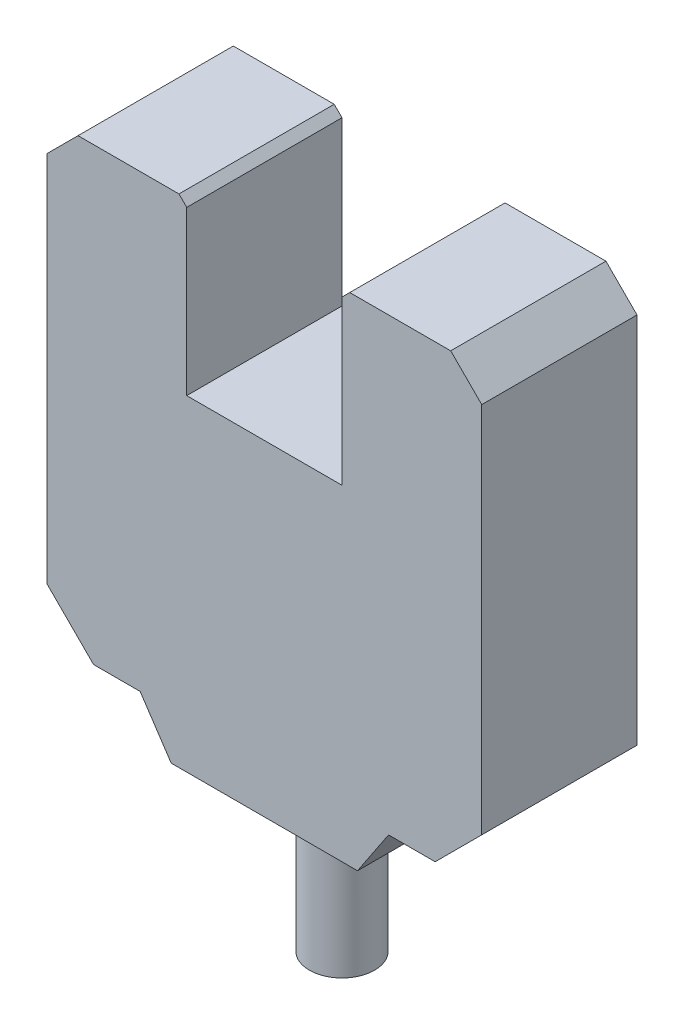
ISO-10303-21;
HEADER;
FILE_DESCRIPTION(('STEP AP214'),'2;1');
FILE_NAME('part.step','',(''),(''),'','','');
FILE_SCHEMA(('AUTOMOTIVE_DESIGN { 1 0 10303 214 1 1 1 1 }'));
ENDSEC;
DATA;
#1=APPLICATION_CONTEXT('core data for automotive mechanical design processes');
#2=APPLICATION_PROTOCOL_DEFINITION('international standard','automotive_design',2000,#1);
#3=PRODUCT_CONTEXT('',#1,'mechanical');
#4=PRODUCT('Part','Part','',(#3));
#5=PRODUCT_RELATED_PRODUCT_CATEGORY('part','',(#4));
#6=PRODUCT_DEFINITION_FORMATION('','',#4);
#7=PRODUCT_DEFINITION_CONTEXT('part definition',#1,'design');
#8=PRODUCT_DEFINITION('design','',#6,#7);
#9=PRODUCT_DEFINITION_SHAPE('','',#8);
#10=(LENGTH_UNIT() NAMED_UNIT(*) SI_UNIT(.MILLI.,.METRE.));
#11=(NAMED_UNIT(*) PLANE_ANGLE_UNIT() SI_UNIT($,.RADIAN.));
#12=(NAMED_UNIT(*) SI_UNIT($,.STERADIAN.) SOLID_ANGLE_UNIT());
#13=UNCERTAINTY_MEASURE_WITH_UNIT(LENGTH_MEASURE(1.E-05),#10,'distance_accuracy_value','');
#14=(GEOMETRIC_REPRESENTATION_CONTEXT(3) GLOBAL_UNCERTAINTY_ASSIGNED_CONTEXT((#13)) GLOBAL_UNIT_ASSIGNED_CONTEXT((#10,
#11,#12)) REPRESENTATION_CONTEXT('',''));
#15=CARTESIAN_POINT('',(0.,0.,0.));
#16=DIRECTION('',(0.,0.,1.));
#17=DIRECTION('',(1.,0.,0.));
#18=AXIS2_PLACEMENT_3D('',#15,#16,#17);
#19=CARTESIAN_POINT('',(8.5,32.,10.));
#20=DIRECTION('',(-0.707106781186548,-0.707106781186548,0.));
#21=DIRECTION('',(0.707106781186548,-0.707106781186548,0.));
#22=AXIS2_PLACEMENT_3D('',#19,#20,#21);
#23=PLANE('',#22);
#24=DIRECTION('',(-0.707106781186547,0.707106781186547,0.));
#25=VECTOR('',#24,1.);
#26=CARTESIAN_POINT('',(8.5,32.,0.));
#27=LINE('',#26,#25);
#28=CARTESIAN_POINT('',(9.,31.5,0.));
#29=VERTEX_POINT('',#28);
#30=CARTESIAN_POINT('',(8.5,32.,0.));
#31=VERTEX_POINT('',#30);
#32=EDGE_CURVE('E192',#29,#31,#27,.T.);
#33=ORIENTED_EDGE('',*,*,#32,.T.);
#34=DIRECTION('',(0.,0.,-1.));
#35=VECTOR('',#34,1.);
#36=CARTESIAN_POINT('',(8.5,32.,10.));
#37=LINE('',#36,#35);
#38=CARTESIAN_POINT('',(8.5,32.,10.));
#39=VERTEX_POINT('',#38);
#40=EDGE_CURVE('E43',#39,#31,#37,.T.);
#41=ORIENTED_EDGE('',*,*,#40,.F.);
#42=DIRECTION('',(-0.707106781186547,0.707106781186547,0.));
#43=VECTOR('',#42,1.);
#44=CARTESIAN_POINT('',(8.5,32.,10.));
#45=LINE('',#44,#43);
#46=CARTESIAN_POINT('',(9.,31.5,10.));
#47=VERTEX_POINT('',#46);
#48=EDGE_CURVE('E228',#47,#39,#45,.T.);
#49=ORIENTED_EDGE('',*,*,#48,.F.);
#50=DIRECTION('',(0.,0.,-1.));
#51=VECTOR('',#50,1.);
#52=CARTESIAN_POINT('',(9.,31.5,10.));
#53=LINE('',#52,#51);
#54=EDGE_CURVE('E188',#47,#29,#53,.T.);
#55=ORIENTED_EDGE('',*,*,#54,.T.);
#56=EDGE_LOOP('',(#33,#41,#49,#55));
#57=FACE_BOUND('',#56,.T.);
#58=ADVANCED_FACE('F35',(#57),#23,.F.);
#59=CARTESIAN_POINT('',(2.,32.,10.));
#60=DIRECTION('',(0.,-1.,0.));
#61=DIRECTION('',(0.,0.,-1.));
#62=AXIS2_PLACEMENT_3D('',#59,#60,#61);
#63=PLANE('',#62);
#64=DIRECTION('',(-1.,0.,0.));
#65=VECTOR('',#64,1.);
#66=CARTESIAN_POINT('',(2.,32.,0.));
#67=LINE('',#66,#65);
#68=CARTESIAN_POINT('',(2.,32.,0.));
#69=VERTEX_POINT('',#68);
#70=EDGE_CURVE('E195',#31,#69,#67,.T.);
#71=ORIENTED_EDGE('',*,*,#70,.T.);
#72=DIRECTION('',(0.,0.,-1.));
#73=VECTOR('',#72,1.);
#74=CARTESIAN_POINT('',(2.,32.,10.));
#75=LINE('',#74,#73);
#76=CARTESIAN_POINT('',(2.,32.,10.));
#77=VERTEX_POINT('',#76);
#78=EDGE_CURVE('E268',#77,#69,#75,.T.);
#79=ORIENTED_EDGE('',*,*,#78,.F.);
#80=DIRECTION('',(-1.,0.,0.));
#81=VECTOR('',#80,1.);
#82=CARTESIAN_POINT('',(2.,32.,10.));
#83=LINE('',#82,#81);
#84=EDGE_CURVE('E125',#39,#77,#83,.T.);
#85=ORIENTED_EDGE('',*,*,#84,.F.);
#86=ORIENTED_EDGE('',*,*,#40,.T.);
#87=EDGE_LOOP('',(#71,#79,#85,#86));
#88=FACE_BOUND('',#87,.T.);
#89=ADVANCED_FACE('F271',(#88),#63,.F.);
#90=CARTESIAN_POINT('',(0.,30.,10.));
#91=DIRECTION('',(0.707106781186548,-0.707106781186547,0.));
#92=DIRECTION('',(0.707106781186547,0.707106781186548,0.));
#93=AXIS2_PLACEMENT_3D('',#90,#91,#92);
#94=PLANE('',#93);
#95=DIRECTION('',(-0.707106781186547,-0.707106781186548,0.));
#96=VECTOR('',#95,1.);
#97=CARTESIAN_POINT('',(0.,30.,0.));
#98=LINE('',#97,#96);
#99=CARTESIAN_POINT('',(0.,30.,0.));
#100=VERTEX_POINT('',#99);
#101=EDGE_CURVE('E198',#69,#100,#98,.T.);
#102=ORIENTED_EDGE('',*,*,#101,.T.);
#103=DIRECTION('',(0.,0.,-1.));
#104=VECTOR('',#103,1.);
#105=CARTESIAN_POINT('',(0.,30.,10.));
#106=LINE('',#105,#104);
#107=CARTESIAN_POINT('',(0.,30.,10.));
#108=VERTEX_POINT('',#107);
#109=EDGE_CURVE('E265',#108,#100,#106,.T.);
#110=ORIENTED_EDGE('',*,*,#109,.F.);
#111=DIRECTION('',(-0.707106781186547,-0.707106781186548,0.));
#112=VECTOR('',#111,1.);
#113=CARTESIAN_POINT('',(0.,30.,10.));
#114=LINE('',#113,#112);
#115=EDGE_CURVE('E291',#77,#108,#114,.T.);
#116=ORIENTED_EDGE('',*,*,#115,.F.);
#117=ORIENTED_EDGE('',*,*,#78,.T.);
#118=EDGE_LOOP('',(#102,#110,#116,#117));
#119=FACE_BOUND('',#118,.T.);
#120=ADVANCED_FACE('F282',(#119),#94,.F.);
#121=CARTESIAN_POINT('',(0.,6.,10.));
#122=DIRECTION('',(1.,0.,0.));
#123=DIRECTION('',(0.,0.,-1.));
#124=AXIS2_PLACEMENT_3D('',#121,#122,#123);
#125=PLANE('',#124);
#126=DIRECTION('',(0.,-1.,0.));
#127=VECTOR('',#126,1.);
#128=CARTESIAN_POINT('',(0.,6.,0.));
#129=LINE('',#128,#127);
#130=CARTESIAN_POINT('',(0.,6.,0.));
#131=VERTEX_POINT('',#130);
#132=EDGE_CURVE('E200',#100,#131,#129,.T.);
#133=ORIENTED_EDGE('',*,*,#132,.T.);
#134=DIRECTION('',(0.,0.,-1.));
#135=VECTOR('',#134,1.);
#136=CARTESIAN_POINT('',(0.,6.,10.));
#137=LINE('',#136,#135);
#138=CARTESIAN_POINT('',(0.,6.,10.));
#139=VERTEX_POINT('',#138);
#140=EDGE_CURVE('E262',#139,#131,#137,.T.);
#141=ORIENTED_EDGE('',*,*,#140,.F.);
#142=DIRECTION('',(0.,-1.,0.));
#143=VECTOR('',#142,1.);
#144=CARTESIAN_POINT('',(0.,6.,10.));
#145=LINE('',#144,#143);
#146=EDGE_CURVE('E288',#108,#139,#145,.T.);
#147=ORIENTED_EDGE('',*,*,#146,.F.);
#148=ORIENTED_EDGE('',*,*,#109,.T.);
#149=EDGE_LOOP('',(#133,#141,#147,#148));
#150=FACE_BOUND('',#149,.T.);
#151=ADVANCED_FACE('F286',(#150),#125,.F.);
#152=CARTESIAN_POINT('',(3.,3.,10.));
#153=DIRECTION('',(0.707106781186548,0.707106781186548,0.));
#154=DIRECTION('',(-0.707106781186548,0.707106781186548,0.));
#155=AXIS2_PLACEMENT_3D('',#152,#153,#154);
#156=PLANE('',#155);
#157=DIRECTION('',(0.707106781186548,-0.707106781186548,0.));
#158=VECTOR('',#157,1.);
#159=CARTESIAN_POINT('',(3.,3.,0.));
#160=LINE('',#159,#158);
#161=CARTESIAN_POINT('',(3.,3.,0.));
#162=VERTEX_POINT('',#161);
#163=EDGE_CURVE('E202',#131,#162,#160,.T.);
#164=ORIENTED_EDGE('',*,*,#163,.T.);
#165=DIRECTION('',(0.,0.,-1.));
#166=VECTOR('',#165,1.);
#167=CARTESIAN_POINT('',(3.,3.,10.));
#168=LINE('',#167,#166);
#169=CARTESIAN_POINT('',(3.,3.,10.));
#170=VERTEX_POINT('',#169);
#171=EDGE_CURVE('E259',#170,#162,#168,.T.);
#172=ORIENTED_EDGE('',*,*,#171,.F.);
#173=DIRECTION('',(0.707106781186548,-0.707106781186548,0.));
#174=VECTOR('',#173,1.);
#175=CARTESIAN_POINT('',(3.,3.,10.));
#176=LINE('',#175,#174);
#177=EDGE_CURVE('E290',#139,#170,#176,.T.);
#178=ORIENTED_EDGE('',*,*,#177,.F.);
#179=ORIENTED_EDGE('',*,*,#140,.T.);
#180=EDGE_LOOP('',(#164,#172,#178,#179));
#181=FACE_BOUND('',#180,.T.);
#182=ADVANCED_FACE('F363',(#181),#156,.F.);
#183=CARTESIAN_POINT('',(6.,3.,10.));
#184=DIRECTION('',(0.,1.,0.));
#185=DIRECTION('',(-1.,0.,0.));
#186=AXIS2_PLACEMENT_3D('',#183,#184,#185);
#187=PLANE('',#186);
#188=DIRECTION('',(1.,0.,0.));
#189=VECTOR('',#188,1.);
#190=CARTESIAN_POINT('',(6.,3.,0.));
#191=LINE('',#190,#189);
#192=CARTESIAN_POINT('',(6.,3.,0.));
#193=VERTEX_POINT('',#192);
#194=EDGE_CURVE('E204',#162,#193,#191,.T.);
#195=ORIENTED_EDGE('',*,*,#194,.T.);
#196=DIRECTION('',(0.,0.,-1.));
#197=VECTOR('',#196,1.);
#198=CARTESIAN_POINT('',(6.,3.,10.));
#199=LINE('',#198,#197);
#200=CARTESIAN_POINT('',(6.,3.,10.));
#201=VERTEX_POINT('',#200);
#202=EDGE_CURVE('E256',#201,#193,#199,.T.);
#203=ORIENTED_EDGE('',*,*,#202,.F.);
#204=DIRECTION('',(1.,0.,0.));
#205=VECTOR('',#204,1.);
#206=CARTESIAN_POINT('',(6.,3.,10.));
#207=LINE('',#206,#205);
#208=EDGE_CURVE('E293',#170,#201,#207,.T.);
#209=ORIENTED_EDGE('',*,*,#208,.F.);
#210=ORIENTED_EDGE('',*,*,#171,.T.);
#211=EDGE_LOOP('',(#195,#203,#209,#210));
#212=FACE_BOUND('',#211,.T.);
#213=ADVANCED_FACE('F360',(#212),#187,.F.);
#214=CARTESIAN_POINT('',(8.,0.,10.));
#215=DIRECTION('',(0.832050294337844,0.554700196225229,0.));
#216=DIRECTION('',(-0.554700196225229,0.832050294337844,0.));
#217=AXIS2_PLACEMENT_3D('',#214,#215,#216);
#218=PLANE('',#217);
#219=DIRECTION('',(0.554700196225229,-0.832050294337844,0.));
#220=VECTOR('',#219,1.);
#221=CARTESIAN_POINT('',(8.,0.,0.));
#222=LINE('',#221,#220);
#223=CARTESIAN_POINT('',(8.,0.,0.));
#224=VERTEX_POINT('',#223);
#225=EDGE_CURVE('E206',#193,#224,#222,.T.);
#226=ORIENTED_EDGE('',*,*,#225,.T.);
#227=DIRECTION('',(0.,0.,-1.));
#228=VECTOR('',#227,1.);
#229=CARTESIAN_POINT('',(8.,0.,10.));
#230=LINE('',#229,#228);
#231=CARTESIAN_POINT('',(8.,0.,10.));
#232=VERTEX_POINT('',#231);
#233=EDGE_CURVE('E253',#232,#224,#230,.T.);
#234=ORIENTED_EDGE('',*,*,#233,.F.);
#235=DIRECTION('',(0.554700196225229,-0.832050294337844,0.));
#236=VECTOR('',#235,1.);
#237=CARTESIAN_POINT('',(8.,0.,10.));
#238=LINE('',#237,#236);
#239=EDGE_CURVE('E299',#201,#232,#238,.T.);
#240=ORIENTED_EDGE('',*,*,#239,.F.);
#241=ORIENTED_EDGE('',*,*,#202,.T.);
#242=EDGE_LOOP('',(#226,#234,#240,#241));
#243=FACE_BOUND('',#242,.T.);
#244=ADVANCED_FACE('F355',(#243),#218,.F.);
#245=CARTESIAN_POINT('',(14.,0.,10.));
#246=DIRECTION('',(0.,1.,0.));
#247=DIRECTION('',(-1.,0.,0.));
#248=AXIS2_PLACEMENT_3D('',#245,#246,#247);
#249=PLANE('',#248);
#250=CARTESIAN_POINT('',(14.,0.,5.));
#251=DIRECTION('',(0.,1.,0.));
#252=DIRECTION('',(-1.,0.,0.));
#253=AXIS2_PLACEMENT_3D('',#250,#251,#252);
#254=CIRCLE('',#253,2.1);
#255=CARTESIAN_POINT('',(11.9,0.,5.));
#256=VERTEX_POINT('',#255);
#257=EDGE_CURVE('E11',#256,#256,#254,.F.);
#258=ORIENTED_EDGE('',*,*,#257,.F.);
#259=EDGE_LOOP('',(#258));
#260=FACE_BOUND('',#259,.T.);
#261=DIRECTION('',(1.,0.,0.));
#262=VECTOR('',#261,1.);
#263=CARTESIAN_POINT('',(14.,0.,0.));
#264=LINE('',#263,#262);
#265=CARTESIAN_POINT('',(20.,0.,0.));
#266=VERTEX_POINT('',#265);
#267=EDGE_CURVE('E209',#224,#266,#264,.T.);
#268=ORIENTED_EDGE('',*,*,#267,.T.);
#269=DIRECTION('',(0.,0.,-1.));
#270=VECTOR('',#269,1.);
#271=CARTESIAN_POINT('',(20.,0.,10.));
#272=LINE('',#271,#270);
#273=CARTESIAN_POINT('',(20.,0.,10.));
#274=VERTEX_POINT('',#273);
#275=EDGE_CURVE('E250',#274,#266,#272,.T.);
#276=ORIENTED_EDGE('',*,*,#275,.F.);
#277=DIRECTION('',(1.,0.,0.));
#278=VECTOR('',#277,1.);
#279=CARTESIAN_POINT('',(14.,0.,10.));
#280=LINE('',#279,#278);
#281=EDGE_CURVE('E301',#232,#274,#280,.T.);
#282=ORIENTED_EDGE('',*,*,#281,.F.);
#283=ORIENTED_EDGE('',*,*,#233,.T.);
#284=EDGE_LOOP('',(#268,#276,#282,#283));
#285=FACE_BOUND('',#284,.T.);
#286=ADVANCED_FACE('F350',(#260,#285),#249,.F.);
#287=CARTESIAN_POINT('',(20.,0.,10.));
#288=DIRECTION('',(-0.832050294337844,0.554700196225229,0.));
#289=DIRECTION('',(-0.554700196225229,-0.832050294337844,0.));
#290=AXIS2_PLACEMENT_3D('',#287,#288,#289);
#291=PLANE('',#290);
#292=DIRECTION('',(0.554700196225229,0.832050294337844,0.));
#293=VECTOR('',#292,1.);
#294=CARTESIAN_POINT('',(20.,0.,0.));
#295=LINE('',#294,#293);
#296=CARTESIAN_POINT('',(22.,3.,0.));
#297=VERTEX_POINT('',#296);
#298=EDGE_CURVE('E211',#266,#297,#295,.T.);
#299=ORIENTED_EDGE('',*,*,#298,.T.);
#300=DIRECTION('',(0.,0.,-1.));
#301=VECTOR('',#300,1.);
#302=CARTESIAN_POINT('',(22.,3.,10.));
#303=LINE('',#302,#301);
#304=CARTESIAN_POINT('',(22.,3.,10.));
#305=VERTEX_POINT('',#304);
#306=EDGE_CURVE('E247',#305,#297,#303,.T.);
#307=ORIENTED_EDGE('',*,*,#306,.F.);
#308=DIRECTION('',(0.554700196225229,0.832050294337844,0.));
#309=VECTOR('',#308,1.);
#310=CARTESIAN_POINT('',(20.,0.,10.));
#311=LINE('',#310,#309);
#312=EDGE_CURVE('E303',#274,#305,#311,.T.);
#313=ORIENTED_EDGE('',*,*,#312,.F.);
#314=ORIENTED_EDGE('',*,*,#275,.T.);
#315=EDGE_LOOP('',(#299,#307,#313,#314));
#316=FACE_BOUND('',#315,.T.);
#317=ADVANCED_FACE('F346',(#316),#291,.F.);
#318=CARTESIAN_POINT('',(25.,3.,10.));
#319=DIRECTION('',(0.,1.,0.));
#320=DIRECTION('',(-1.,0.,0.));
#321=AXIS2_PLACEMENT_3D('',#318,#319,#320);
#322=PLANE('',#321);
#323=DIRECTION('',(1.,0.,0.));
#324=VECTOR('',#323,1.);
#325=CARTESIAN_POINT('',(25.,3.,0.));
#326=LINE('',#325,#324);
#327=CARTESIAN_POINT('',(25.,3.,0.));
#328=VERTEX_POINT('',#327);
#329=EDGE_CURVE('E213',#297,#328,#326,.T.);
#330=ORIENTED_EDGE('',*,*,#329,.T.);
#331=DIRECTION('',(0.,0.,-1.));
#332=VECTOR('',#331,1.);
#333=CARTESIAN_POINT('',(25.,3.,10.));
#334=LINE('',#333,#332);
#335=CARTESIAN_POINT('',(25.,3.,10.));
#336=VERTEX_POINT('',#335);
#337=EDGE_CURVE('E244',#336,#328,#334,.T.);
#338=ORIENTED_EDGE('',*,*,#337,.F.);
#339=DIRECTION('',(1.,0.,0.));
#340=VECTOR('',#339,1.);
#341=CARTESIAN_POINT('',(25.,3.,10.));
#342=LINE('',#341,#340);
#343=EDGE_CURVE('E305',#305,#336,#342,.T.);
#344=ORIENTED_EDGE('',*,*,#343,.F.);
#345=ORIENTED_EDGE('',*,*,#306,.T.);
#346=EDGE_LOOP('',(#330,#338,#344,#345));
#347=FACE_BOUND('',#346,.T.);
#348=ADVANCED_FACE('F341',(#347),#322,.F.);
#349=CARTESIAN_POINT('',(28.,6.,10.));
#350=DIRECTION('',(-0.707106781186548,0.707106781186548,0.));
#351=DIRECTION('',(-0.707106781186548,-0.707106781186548,0.));
#352=AXIS2_PLACEMENT_3D('',#349,#350,#351);
#353=PLANE('',#352);
#354=DIRECTION('',(0.707106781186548,0.707106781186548,0.));
#355=VECTOR('',#354,1.);
#356=CARTESIAN_POINT('',(28.,6.,0.));
#357=LINE('',#356,#355);
#358=CARTESIAN_POINT('',(28.,6.,0.));
#359=VERTEX_POINT('',#358);
#360=EDGE_CURVE('E215',#328,#359,#357,.T.);
#361=ORIENTED_EDGE('',*,*,#360,.T.);
#362=DIRECTION('',(0.,0.,-1.));
#363=VECTOR('',#362,1.);
#364=CARTESIAN_POINT('',(28.,6.,10.));
#365=LINE('',#364,#363);
#366=CARTESIAN_POINT('',(28.,6.,10.));
#367=VERTEX_POINT('',#366);
#368=EDGE_CURVE('E241',#367,#359,#365,.T.);
#369=ORIENTED_EDGE('',*,*,#368,.F.);
#370=DIRECTION('',(0.707106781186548,0.707106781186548,0.));
#371=VECTOR('',#370,1.);
#372=CARTESIAN_POINT('',(28.,6.,10.));
#373=LINE('',#372,#371);
#374=EDGE_CURVE('E307',#336,#367,#373,.T.);
#375=ORIENTED_EDGE('',*,*,#374,.F.);
#376=ORIENTED_EDGE('',*,*,#337,.T.);
#377=EDGE_LOOP('',(#361,#369,#375,#376));
#378=FACE_BOUND('',#377,.T.);
#379=ADVANCED_FACE('F336',(#378),#353,.F.);
#380=CARTESIAN_POINT('',(28.,30.,10.));
#381=DIRECTION('',(-1.,0.,0.));
#382=DIRECTION('',(0.,0.,1.));
#383=AXIS2_PLACEMENT_3D('',#380,#381,#382);
#384=PLANE('',#383);
#385=DIRECTION('',(0.,1.,0.));
#386=VECTOR('',#385,1.);
#387=CARTESIAN_POINT('',(28.,30.,0.));
#388=LINE('',#387,#386);
#389=CARTESIAN_POINT('',(28.,30.,0.));
#390=VERTEX_POINT('',#389);
#391=EDGE_CURVE('E217',#359,#390,#388,.T.);
#392=ORIENTED_EDGE('',*,*,#391,.T.);
#393=DIRECTION('',(0.,0.,-1.));
#394=VECTOR('',#393,1.);
#395=CARTESIAN_POINT('',(28.,30.,10.));
#396=LINE('',#395,#394);
#397=CARTESIAN_POINT('',(28.,30.,10.));
#398=VERTEX_POINT('',#397);
#399=EDGE_CURVE('E238',#398,#390,#396,.T.);
#400=ORIENTED_EDGE('',*,*,#399,.F.);
#401=DIRECTION('',(0.,1.,0.));
#402=VECTOR('',#401,1.);
#403=CARTESIAN_POINT('',(28.,30.,10.));
#404=LINE('',#403,#402);
#405=EDGE_CURVE('E309',#367,#398,#404,.T.);
#406=ORIENTED_EDGE('',*,*,#405,.F.);
#407=ORIENTED_EDGE('',*,*,#368,.T.);
#408=EDGE_LOOP('',(#392,#400,#406,#407));
#409=FACE_BOUND('',#408,.T.);
#410=ADVANCED_FACE('F332',(#409),#384,.F.);
#411=CARTESIAN_POINT('',(26.,32.,10.));
#412=DIRECTION('',(-0.707106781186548,-0.707106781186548,0.));
#413=DIRECTION('',(0.707106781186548,-0.707106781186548,0.));
#414=AXIS2_PLACEMENT_3D('',#411,#412,#413);
#415=PLANE('',#414);
#416=DIRECTION('',(-0.707106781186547,0.707106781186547,0.));
#417=VECTOR('',#416,1.);
#418=CARTESIAN_POINT('',(26.,32.,0.));
#419=LINE('',#418,#417);
#420=CARTESIAN_POINT('',(26.,32.,0.));
#421=VERTEX_POINT('',#420);
#422=EDGE_CURVE('E219',#390,#421,#419,.T.);
#423=ORIENTED_EDGE('',*,*,#422,.T.);
#424=DIRECTION('',(0.,0.,-1.));
#425=VECTOR('',#424,1.);
#426=CARTESIAN_POINT('',(26.,32.,10.));
#427=LINE('',#426,#425);
#428=CARTESIAN_POINT('',(26.,32.,10.));
#429=VERTEX_POINT('',#428);
#430=EDGE_CURVE('E235',#429,#421,#427,.T.);
#431=ORIENTED_EDGE('',*,*,#430,.F.);
#432=DIRECTION('',(-0.707106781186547,0.707106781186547,0.));
#433=VECTOR('',#432,1.);
#434=CARTESIAN_POINT('',(26.,32.,10.));
#435=LINE('',#434,#433);
#436=EDGE_CURVE('E311',#398,#429,#435,.T.);
#437=ORIENTED_EDGE('',*,*,#436,.F.);
#438=ORIENTED_EDGE('',*,*,#399,.T.);
#439=EDGE_LOOP('',(#423,#431,#437,#438));
#440=FACE_BOUND('',#439,.T.);
#441=ADVANCED_FACE('F328',(#440),#415,.F.);
#442=CARTESIAN_POINT('',(19.5,32.,10.));
#443=DIRECTION('',(0.,-1.,0.));
#444=DIRECTION('',(0.,0.,-1.));
#445=AXIS2_PLACEMENT_3D('',#442,#443,#444);
#446=PLANE('',#445);
#447=DIRECTION('',(-1.,0.,0.));
#448=VECTOR('',#447,1.);
#449=CARTESIAN_POINT('',(19.5,32.,0.));
#450=LINE('',#449,#448);
#451=CARTESIAN_POINT('',(19.5,32.,0.));
#452=VERTEX_POINT('',#451);
#453=EDGE_CURVE('E221',#421,#452,#450,.T.);
#454=ORIENTED_EDGE('',*,*,#453,.T.);
#455=DIRECTION('',(0.,0.,-1.));
#456=VECTOR('',#455,1.);
#457=CARTESIAN_POINT('',(19.5,32.,10.));
#458=LINE('',#457,#456);
#459=CARTESIAN_POINT('',(19.5,32.,10.));
#460=VERTEX_POINT('',#459);
#461=EDGE_CURVE('E232',#460,#452,#458,.T.);
#462=ORIENTED_EDGE('',*,*,#461,.F.);
#463=DIRECTION('',(-1.,0.,0.));
#464=VECTOR('',#463,1.);
#465=CARTESIAN_POINT('',(19.5,32.,10.));
#466=LINE('',#465,#464);
#467=EDGE_CURVE('E313',#429,#460,#466,.T.);
#468=ORIENTED_EDGE('',*,*,#467,.F.);
#469=ORIENTED_EDGE('',*,*,#430,.T.);
#470=EDGE_LOOP('',(#454,#462,#468,#469));
#471=FACE_BOUND('',#470,.T.);
#472=ADVANCED_FACE('F319',(#471),#446,.F.);
#473=CARTESIAN_POINT('',(19.,31.5,10.));
#474=DIRECTION('',(0.707106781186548,-0.707106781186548,0.));
#475=DIRECTION('',(0.707106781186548,0.707106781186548,0.));
#476=AXIS2_PLACEMENT_3D('',#473,#474,#475);
#477=PLANE('',#476);
#478=DIRECTION('',(-0.707106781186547,-0.707106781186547,0.));
#479=VECTOR('',#478,1.);
#480=CARTESIAN_POINT('',(19.,31.5,0.));
#481=LINE('',#480,#479);
#482=CARTESIAN_POINT('',(19.,31.5,0.));
#483=VERTEX_POINT('',#482);
#484=EDGE_CURVE('E223',#452,#483,#481,.T.);
#485=ORIENTED_EDGE('',*,*,#484,.T.);
#486=DIRECTION('',(0.,0.,-1.));
#487=VECTOR('',#486,1.);
#488=CARTESIAN_POINT('',(19.,31.5,10.));
#489=LINE('',#488,#487);
#490=CARTESIAN_POINT('',(19.,31.5,10.));
#491=VERTEX_POINT('',#490);
#492=EDGE_CURVE('E183',#491,#483,#489,.T.);
#493=ORIENTED_EDGE('',*,*,#492,.F.);
#494=DIRECTION('',(-0.707106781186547,-0.707106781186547,0.));
#495=VECTOR('',#494,1.);
#496=CARTESIAN_POINT('',(19.,31.5,10.));
#497=LINE('',#496,#495);
#498=EDGE_CURVE('E174',#460,#491,#497,.T.);
#499=ORIENTED_EDGE('',*,*,#498,.F.);
#500=ORIENTED_EDGE('',*,*,#461,.T.);
#501=EDGE_LOOP('',(#485,#493,#499,#500));
#502=FACE_BOUND('',#501,.T.);
#503=ADVANCED_FACE('F323',(#502),#477,.F.);
#504=CARTESIAN_POINT('',(19.,21.,10.));
#505=DIRECTION('',(1.,0.,0.));
#506=DIRECTION('',(0.,0.,-1.));
#507=AXIS2_PLACEMENT_3D('',#504,#505,#506);
#508=PLANE('',#507);
#509=DIRECTION('',(0.,-1.,0.));
#510=VECTOR('',#509,1.);
#511=CARTESIAN_POINT('',(19.,21.,0.));
#512=LINE('',#511,#510);
#513=CARTESIAN_POINT('',(19.,21.,0.));
#514=VERTEX_POINT('',#513);
#515=EDGE_CURVE('E182',#483,#514,#512,.T.);
#516=ORIENTED_EDGE('',*,*,#515,.T.);
#517=DIRECTION('',(0.,0.,-1.));
#518=VECTOR('',#517,1.);
#519=CARTESIAN_POINT('',(19.,21.,10.));
#520=LINE('',#519,#518);
#521=CARTESIAN_POINT('',(19.,21.,10.));
#522=VERTEX_POINT('',#521);
#523=EDGE_CURVE('E179',#522,#514,#520,.T.);
#524=ORIENTED_EDGE('',*,*,#523,.F.);
#525=DIRECTION('',(0.,-1.,0.));
#526=VECTOR('',#525,1.);
#527=CARTESIAN_POINT('',(19.,21.,10.));
#528=LINE('',#527,#526);
#529=EDGE_CURVE('E168',#491,#522,#528,.T.);
#530=ORIENTED_EDGE('',*,*,#529,.F.);
#531=ORIENTED_EDGE('',*,*,#492,.T.);
#532=EDGE_LOOP('',(#516,#524,#530,#531));
#533=FACE_BOUND('',#532,.T.);
#534=ADVANCED_FACE('F180',(#533),#508,.F.);
#535=CARTESIAN_POINT('',(9.,21.,10.));
#536=DIRECTION('',(0.,-1.,0.));
#537=DIRECTION('',(0.,0.,-1.));
#538=AXIS2_PLACEMENT_3D('',#535,#536,#537);
#539=PLANE('',#538);
#540=DIRECTION('',(-1.,0.,0.));
#541=VECTOR('',#540,1.);
#542=CARTESIAN_POINT('',(9.,21.,0.));
#543=LINE('',#542,#541);
#544=CARTESIAN_POINT('',(9.,21.,0.));
#545=VERTEX_POINT('',#544);
#546=EDGE_CURVE('E110',#514,#545,#543,.T.);
#547=ORIENTED_EDGE('',*,*,#546,.T.);
#548=DIRECTION('',(0.,0.,-1.));
#549=VECTOR('',#548,1.);
#550=CARTESIAN_POINT('',(9.,21.,10.));
#551=LINE('',#550,#549);
#552=CARTESIAN_POINT('',(9.,21.,10.));
#553=VERTEX_POINT('',#552);
#554=EDGE_CURVE('E184',#553,#545,#551,.T.);
#555=ORIENTED_EDGE('',*,*,#554,.F.);
#556=DIRECTION('',(-1.,0.,0.));
#557=VECTOR('',#556,1.);
#558=CARTESIAN_POINT('',(9.,21.,10.));
#559=LINE('',#558,#557);
#560=EDGE_CURVE('E172',#522,#553,#559,.T.);
#561=ORIENTED_EDGE('',*,*,#560,.F.);
#562=ORIENTED_EDGE('',*,*,#523,.T.);
#563=EDGE_LOOP('',(#547,#555,#561,#562));
#564=FACE_BOUND('',#563,.T.);
#565=ADVANCED_FACE('F186',(#564),#539,.F.);
#566=CARTESIAN_POINT('',(9.,31.5,10.));
#567=DIRECTION('',(-1.,0.,0.));
#568=DIRECTION('',(0.,-1.,0.));
#569=AXIS2_PLACEMENT_3D('',#566,#567,#568);
#570=PLANE('',#569);
#571=DIRECTION('',(0.,1.,0.));
#572=VECTOR('',#571,1.);
#573=CARTESIAN_POINT('',(9.,31.5,0.));
#574=LINE('',#573,#572);
#575=EDGE_CURVE('E116',#545,#29,#574,.T.);
#576=ORIENTED_EDGE('',*,*,#575,.T.);
#577=ORIENTED_EDGE('',*,*,#54,.F.);
#578=DIRECTION('',(0.,1.,0.));
#579=VECTOR('',#578,1.);
#580=CARTESIAN_POINT('',(9.,31.5,10.));
#581=LINE('',#580,#579);
#582=EDGE_CURVE('E51',#553,#47,#581,.T.);
#583=ORIENTED_EDGE('',*,*,#582,.F.);
#584=ORIENTED_EDGE('',*,*,#554,.T.);
#585=EDGE_LOOP('',(#576,#577,#583,#584));
#586=FACE_BOUND('',#585,.T.);
#587=ADVANCED_FACE('F480',(#586),#570,.F.);
#588=CARTESIAN_POINT('',(0.,0.,10.));
#589=DIRECTION('',(0.,0.,1.));
#590=DIRECTION('',(1.,0.,0.));
#591=AXIS2_PLACEMENT_3D('',#588,#589,#590);
#592=PLANE('',#591);
#593=ORIENTED_EDGE('',*,*,#48,.T.);
#594=ORIENTED_EDGE('',*,*,#84,.T.);
#595=ORIENTED_EDGE('',*,*,#115,.T.);
#596=ORIENTED_EDGE('',*,*,#146,.T.);
#597=ORIENTED_EDGE('',*,*,#177,.T.);
#598=ORIENTED_EDGE('',*,*,#208,.T.);
#599=ORIENTED_EDGE('',*,*,#239,.T.);
#600=ORIENTED_EDGE('',*,*,#281,.T.);
#601=ORIENTED_EDGE('',*,*,#312,.T.);
#602=ORIENTED_EDGE('',*,*,#343,.T.);
#603=ORIENTED_EDGE('',*,*,#374,.T.);
#604=ORIENTED_EDGE('',*,*,#405,.T.);
#605=ORIENTED_EDGE('',*,*,#436,.T.);
#606=ORIENTED_EDGE('',*,*,#467,.T.);
#607=ORIENTED_EDGE('',*,*,#498,.T.);
#608=ORIENTED_EDGE('',*,*,#529,.T.);
#609=ORIENTED_EDGE('',*,*,#560,.T.);
#610=ORIENTED_EDGE('',*,*,#582,.T.);
#611=EDGE_LOOP('',(#593,#594,#595,#596,#597,#598,#599,#600,#601,#602,#603,#604,#605,#606,#607,
#608,#609,#610));
#612=FACE_BOUND('',#611,.T.);
#613=ADVANCED_FACE('F170',(#612),#592,.T.);
#614=CARTESIAN_POINT('',(0.,0.,0.));
#615=DIRECTION('',(0.,0.,1.));
#616=DIRECTION('',(1.,0.,0.));
#617=AXIS2_PLACEMENT_3D('',#614,#615,#616);
#618=PLANE('',#617);
#619=ORIENTED_EDGE('',*,*,#32,.F.);
#620=ORIENTED_EDGE('',*,*,#575,.F.);
#621=ORIENTED_EDGE('',*,*,#546,.F.);
#622=ORIENTED_EDGE('',*,*,#515,.F.);
#623=ORIENTED_EDGE('',*,*,#484,.F.);
#624=ORIENTED_EDGE('',*,*,#453,.F.);
#625=ORIENTED_EDGE('',*,*,#422,.F.);
#626=ORIENTED_EDGE('',*,*,#391,.F.);
#627=ORIENTED_EDGE('',*,*,#360,.F.);
#628=ORIENTED_EDGE('',*,*,#329,.F.);
#629=ORIENTED_EDGE('',*,*,#298,.F.);
#630=ORIENTED_EDGE('',*,*,#267,.F.);
#631=ORIENTED_EDGE('',*,*,#225,.F.);
#632=ORIENTED_EDGE('',*,*,#194,.F.);
#633=ORIENTED_EDGE('',*,*,#163,.F.);
#634=ORIENTED_EDGE('',*,*,#132,.F.);
#635=ORIENTED_EDGE('',*,*,#101,.F.);
#636=ORIENTED_EDGE('',*,*,#70,.F.);
#637=EDGE_LOOP('',(#619,#620,#621,#622,#623,#624,#625,#626,#627,#628,#629,#630,#631,#632,#633,
#634,#635,#636));
#638=FACE_BOUND('',#637,.T.);
#639=ADVANCED_FACE('F276',(#638),#618,.F.);
#640=CARTESIAN_POINT('',(14.,-10.,5.));
#641=DIRECTION('',(0.,1.,0.));
#642=DIRECTION('',(-1.,0.,0.));
#643=AXIS2_PLACEMENT_3D('',#640,#641,#642);
#644=CYLINDRICAL_SURFACE('',#643,2.1);
#645=CARTESIAN_POINT('',(14.,-10.,5.));
#646=DIRECTION('',(0.,-1.,0.));
#647=DIRECTION('',(1.,0.,0.));
#648=AXIS2_PLACEMENT_3D('',#645,#646,#647);
#649=CIRCLE('',#648,2.1);
#650=CARTESIAN_POINT('',(16.1,-10.,5.));
#651=VERTEX_POINT('',#650);
#652=EDGE_CURVE('E196',#651,#651,#649,.T.);
#653=ORIENTED_EDGE('',*,*,#652,.F.);
#654=EDGE_LOOP('',(#653));
#655=FACE_BOUND('',#654,.T.);
#656=ORIENTED_EDGE('',*,*,#257,.T.);
#657=EDGE_LOOP('',(#656));
#658=FACE_BOUND('',#657,.T.);
#659=ADVANCED_FACE('F505',(#655,#658),#644,.T.);
#660=CARTESIAN_POINT('',(14.,-10.,5.));
#661=DIRECTION('',(0.,-1.,0.));
#662=DIRECTION('',(1.,0.,0.));
#663=AXIS2_PLACEMENT_3D('',#660,#661,#662);
#664=PLANE('',#663);
#665=ORIENTED_EDGE('',*,*,#652,.T.);
#666=EDGE_LOOP('',(#665));
#667=FACE_BOUND('',#666,.T.);
#668=ADVANCED_FACE('F521',(#667),#664,.T.);
#669=CLOSED_SHELL('',(#58,#89,#120,#151,#182,#213,#244,#286,#317,#348,#379,#410,#441,#472,#503,
#534,#565,#587,#613,#639,#659,#668));
#670=MANIFOLD_SOLID_BREP('B2',#669);
#671=ADVANCED_BREP_SHAPE_REPRESENTATION('',(#18,#670),#14);
#672=SHAPE_DEFINITION_REPRESENTATION(#9,#671);
ENDSEC;
END-ISO-10303-21;
